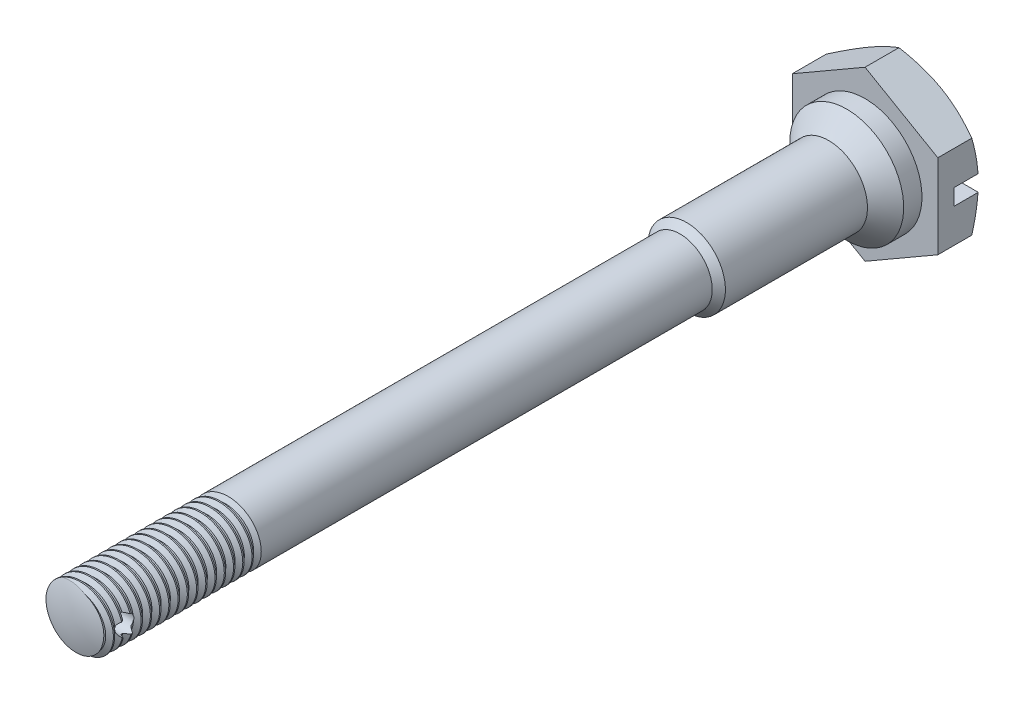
from build123d import *

# Parameters (mm, degrees)
EXTRUDE_1_DEPTH     = 3.96875
SKETCH_4_R          = 0.9271
SKETCH_4_W          = 2.38125
SKETCH_4_H          = 1.5875
CUT_EXTRUDE_1_DEPTH = 80.517746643


with BuildPart() as part:
    # Sketch 1 → Revolve 1 (revolve)
    with BuildSketch(Plane(origin=(0, 0, 0), x_dir=(0, 0, -1), z_dir=(1, 0, 0)), mode=Mode.PRIVATE) as revolve_1_sk:
        with BuildLine():
            Line((-77.7875, 0), (0, 0))
            Line((0, 0), (0, 5.588))
            Line((0, 5.588), (-1.793875, 5.588))
            Line((-1.793875, 5.588), (-3.571875, 3.81))
            Line((-3.571875, 3.81), (-17.5133, 3.81))
            Line((-17.5133, 3.81), (-18.161, 3.1623))
            Line((-18.161, 3.1623), (-77.247236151, 3.1623))
            ThreePointArc((-77.247236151, 3.1623), (-77.651462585, 1.604059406), (-77.7875, 0))
        make_face()
    revolve(revolve_1_sk.sketch.rotate(Axis((0, 0, 0), (0, 0, 1)), 90), axis=Axis((0, 0, 0), (0, 0, 1)))

    # Sketch 2 → Extrude 1 (add)
    with BuildSketch(Plane(origin=(0, 0, 0), x_dir=(-1, 0, 0), z_dir=(0, 0, -1))):
        Polygon((0, 8.248891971), (-7.14375, 4.124445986), (-7.14375, -4.124445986), (0, -8.248891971), (7.14375, -4.124445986), (7.14375, 4.124445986), align=None)
    extrude(amount=EXTRUDE_1_DEPTH)

    # Sketch 3 → Cut-Revolve 1 (revolve, cut)
    with BuildSketch(Plane(origin=(0, 0, 0), x_dir=(0, 0, -1), z_dir=(1, 0, 0))):
        Polygon((3.330695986, 8.248891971), (3.96875, 8.248891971), (3.96875, 7.14375), align=None)
    revolve(axis=Axis((0, 0, 0), (0, 0, -1)), mode=Mode.SUBTRACT)

    # Sketch 4 → Cut-Extrude 1 (cut, through all)
    with BuildSketch(Plane(origin=(7.14375, 0, 0), x_dir=(0, 0, -1), z_dir=(1, 0, 0))):
        with Locations((-75.40625, 0)):
            Circle(SKETCH_4_R)
        with Locations((2.778125, 0)):
            Rectangle(SKETCH_4_W, SKETCH_4_H)
    extrude(amount=-CUT_EXTRUDE_1_DEPTH, mode=Mode.SUBTRACT)

    # Sweep 1: sweep along a curve in space
    with BuildLine() as sweep_1_path:
        add(Edge.make_bspline(
            [(3.175, 0, 77.7875), (3.175, -0.412946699, 77.76872214), (3.009683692, -1.247860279, 77.730747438), (2.303512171, -2.303188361, 77.674122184), (1.246651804, -3.009770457, 77.617406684), (0, -3.257634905, 77.560715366), (-1.246651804, -3.009689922, 77.504017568), (-2.303512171, -2.303510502, 77.447321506), (-3.009683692, -1.246652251, 77.390624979), (-3.257658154, 1.2e-07, 77.333928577), (-3.009683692, 1.246651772, 77.277232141), (-2.303512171, 2.30351218, 77.220535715), (-1.246651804, 3.00968369, 77.163839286), (0, 3.257658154, 77.107142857), (1.246651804, 3.009683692, 77.050446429), (2.303512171, 2.303512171, 76.99375), (3.009683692, 1.246651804, 76.937053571), (3.257658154, 0, 76.880357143), (3.009683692, -1.246651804, 76.823660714), (2.303512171, -2.303512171, 76.766964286), (1.246651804, -3.009683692, 76.710267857), (0, -3.257658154, 76.653571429), (-1.246651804, -3.009683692, 76.596875), (-2.303512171, -2.303512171, 76.540178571), (-3.009683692, -1.246651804, 76.483482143), (-3.257658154, 0, 76.426785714), (-3.009683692, 1.246651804, 76.370089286), (-2.303512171, 2.303512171, 76.313392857), (-1.246651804, 3.009683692, 76.256696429), (0, 3.257658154, 76.2), (1.246651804, 3.009683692, 76.143303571), (2.303512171, 2.303512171, 76.086607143), (3.009683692, 1.246651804, 76.029910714), (3.257658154, 0, 75.973214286), (3.009683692, -1.246651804, 75.916517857), (2.303512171, -2.303512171, 75.859821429), (1.246651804, -3.009683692, 75.803125), (0, -3.257658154, 75.746428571), (-1.246651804, -3.009683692, 75.689732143), (-2.303512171, -2.303512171, 75.633035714), (-3.009683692, -1.246651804, 75.576339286), (-3.257658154, 0, 75.519642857), (-3.009683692, 1.246651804, 75.462946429), (-2.303512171, 2.303512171, 75.40625), (-1.246651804, 3.009683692, 75.349553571), (0, 3.257658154, 75.292857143), (1.246651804, 3.009683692, 75.236160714), (2.303512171, 2.303512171, 75.179464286), (3.009683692, 1.246651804, 75.122767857), (3.257658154, 0, 75.066071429), (3.009683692, -1.246651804, 75.009375), (2.303512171, -2.303512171, 74.952678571), (1.246651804, -3.009683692, 74.895982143), (0, -3.257658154, 74.839285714), (-1.246651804, -3.009683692, 74.782589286), (-2.303512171, -2.303512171, 74.725892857), (-3.009683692, -1.246651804, 74.669196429), (-3.257658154, 0, 74.6125), (-3.009683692, 1.246651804, 74.555803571), (-2.303512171, 2.303512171, 74.499107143), (-1.246651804, 3.009683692, 74.442410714), (0, 3.257658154, 74.385714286), (1.246651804, 3.009683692, 74.329017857), (2.303512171, 2.303512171, 74.272321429), (3.009683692, 1.246651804, 74.215625), (3.257658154, 0, 74.158928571), (3.009683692, -1.246651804, 74.102232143), (2.303512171, -2.303512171, 74.045535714), (1.246651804, -3.009683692, 73.988839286), (0, -3.257658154, 73.932142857), (-1.246651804, -3.009683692, 73.875446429), (-2.303512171, -2.303512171, 73.81875), (-3.009683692, -1.246651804, 73.762053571), (-3.257658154, 0, 73.705357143), (-3.009683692, 1.246651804, 73.648660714), (-2.303512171, 2.303512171, 73.591964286), (-1.246651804, 3.009683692, 73.535267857), (0, 3.257658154, 73.478571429), (1.246651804, 3.009683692, 73.421875), (2.303512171, 2.303512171, 73.365178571), (3.009683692, 1.246651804, 73.308482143), (3.257658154, 0, 73.251785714), (3.009683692, -1.246651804, 73.195089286), (2.303512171, -2.303512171, 73.138392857), (1.246651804, -3.009683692, 73.081696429), (0, -3.257658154, 73.025), (-1.246651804, -3.009683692, 72.968303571), (-2.303512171, -2.303512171, 72.911607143), (-3.009683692, -1.246651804, 72.854910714), (-3.257658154, 0, 72.798214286), (-3.009683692, 1.246651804, 72.741517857), (-2.303512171, 2.303512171, 72.684821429), (-1.246651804, 3.009683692, 72.628125), (0, 3.257658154, 72.571428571), (1.246651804, 3.009683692, 72.514732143), (2.303512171, 2.303512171, 72.458035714), (3.009683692, 1.246651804, 72.401339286), (3.257658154, 0, 72.344642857), (3.009683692, -1.246651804, 72.287946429), (2.303512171, -2.303512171, 72.23125), (1.246651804, -3.009683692, 72.174553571), (0, -3.257658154, 72.117857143), (-1.246651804, -3.009683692, 72.061160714), (-2.303512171, -2.303512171, 72.004464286), (-3.009683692, -1.246651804, 71.947767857), (-3.257658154, 0, 71.891071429), (-3.009683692, 1.246651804, 71.834375), (-2.303512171, 2.303512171, 71.777678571), (-1.246651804, 3.009683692, 71.720982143), (0, 3.257658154, 71.664285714), (1.246651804, 3.009683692, 71.607589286), (2.303512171, 2.303512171, 71.550892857), (3.009683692, 1.246651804, 71.494196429), (3.257658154, 0, 71.4375), (3.009683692, -1.246651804, 71.380803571), (2.303512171, -2.303512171, 71.324107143), (1.246651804, -3.009683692, 71.267410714), (0, -3.257658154, 71.210714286), (-1.246651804, -3.009683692, 71.154017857), (-2.303512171, -2.303512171, 71.097321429), (-3.009683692, -1.246651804, 71.040625), (-3.257658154, 0, 70.983928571), (-3.009683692, 1.246651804, 70.927232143), (-2.303512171, 2.303512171, 70.870535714), (-1.246651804, 3.009683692, 70.813839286), (0, 3.257658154, 70.757142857), (1.246651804, 3.009683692, 70.700446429), (2.303512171, 2.303512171, 70.64375), (3.009683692, 1.246651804, 70.587053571), (3.257658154, 0, 70.530357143), (3.009683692, -1.246651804, 70.473660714), (2.303512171, -2.303512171, 70.416964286), (1.246651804, -3.009683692, 70.360267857), (0, -3.257658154, 70.303571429), (-1.246651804, -3.009683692, 70.246875), (-2.303512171, -2.303512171, 70.190178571), (-3.009683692, -1.246651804, 70.133482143), (-3.257658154, 0, 70.076785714), (-3.009683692, 1.246651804, 70.020089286), (-2.303512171, 2.303512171, 69.963392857), (-1.246651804, 3.009683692, 69.906696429), (0, 3.257658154, 69.85), (1.246651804, 3.009683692, 69.793303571), (2.303512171, 2.303512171, 69.736607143), (3.009683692, 1.246651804, 69.679910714), (3.257658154, 0, 69.623214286), (3.009683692, -1.246651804, 69.566517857), (2.303512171, -2.303512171, 69.509821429), (1.246651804, -3.009683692, 69.453125), (0, -3.257658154, 69.396428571), (-1.246651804, -3.009683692, 69.339732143), (-2.303512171, -2.303512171, 69.283035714), (-3.009683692, -1.246651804, 69.226339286), (-3.257658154, 0, 69.169642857), (-3.009683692, 1.246651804, 69.112946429), (-2.303512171, 2.303512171, 69.05625), (-1.246651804, 3.009683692, 68.999553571), (0, 3.257658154, 68.942857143), (1.246651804, 3.009683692, 68.886160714), (2.303512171, 2.303512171, 68.829464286), (3.009683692, 1.246651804, 68.772767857), (3.257658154, 0, 68.716071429), (3.009683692, -1.246651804, 68.659375), (2.303512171, -2.303512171, 68.602678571), (1.246651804, -3.009683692, 68.545982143), (0, -3.257658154, 68.489285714), (-1.246651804, -3.009683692, 68.432589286), (-2.303512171, -2.303512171, 68.375892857), (-3.009683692, -1.246651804, 68.319196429), (-3.257658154, 0, 68.2625), (-3.009683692, 1.246651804, 68.205803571), (-2.303512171, 2.303512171, 68.149107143), (-1.246651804, 3.009683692, 68.092410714), (0, 3.257658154, 68.035714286), (1.246651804, 3.009683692, 67.979017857), (2.303512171, 2.303512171, 67.922321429), (3.009683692, 1.246651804, 67.865625), (3.257658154, 0, 67.808928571), (3.009683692, -1.246651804, 67.752232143), (2.303512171, -2.303512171, 67.695535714), (1.246651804, -3.009683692, 67.638839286), (0, -3.257658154, 67.582142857), (-1.246651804, -3.009683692, 67.525446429), (-2.303512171, -2.303512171, 67.46875), (-3.009683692, -1.246651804, 67.412053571), (-3.257658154, 0, 67.355357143), (-3.009683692, 1.246651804, 67.298660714), (-2.303512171, 2.303512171, 67.241964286), (-1.246651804, 3.009683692, 67.185267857), (0, 3.257658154, 67.128571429), (1.246651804, 3.009683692, 67.071875), (2.303512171, 2.303512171, 67.015178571), (3.009683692, 1.246651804, 66.958482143), (3.257658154, 0, 66.901785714), (3.009683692, -1.246651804, 66.845089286), (2.303512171, -2.303512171, 66.788392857), (1.246651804, -3.009683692, 66.731696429), (0, -3.257658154, 66.675), (-1.246651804, -3.009683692, 66.618303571), (-2.303512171, -2.303512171, 66.561607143), (-3.009683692, -1.246651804, 66.504910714), (-3.257658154, 0, 66.448214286), (-3.009683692, 1.246651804, 66.391517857), (-2.303512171, 2.303512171, 66.334821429), (-1.246651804, 3.009683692, 66.278125), (0, 3.257658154, 66.221428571), (1.246651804, 3.009683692, 66.164732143), (2.303512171, 2.303512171, 66.108035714), (3.009683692, 1.246651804, 66.051339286), (3.257658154, 0, 65.994642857), (3.009683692, -1.246651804, 65.937946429), (2.303512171, -2.303512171, 65.88125), (1.246651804, -3.009683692, 65.824553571), (0, -3.257658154, 65.767857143), (-1.246651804, -3.009683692, 65.711160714), (-2.303512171, -2.303512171, 65.654464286), (-3.009683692, -1.246651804, 65.597767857), (-3.257658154, 0, 65.541071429), (-3.009683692, 1.246651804, 65.484375), (-2.303512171, 2.303512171, 65.427678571), (-1.246651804, 3.009683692, 65.370982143), (0, 3.257658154, 65.314285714), (1.246651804, 3.009683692, 65.257589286), (2.303512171, 2.303512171, 65.200892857), (3.009683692, 1.246651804, 65.144196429), (3.257658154, 0, 65.0875), (3.009683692, -1.246651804, 65.030803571), (2.303512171, -2.303512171, 64.974107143), (1.246651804, -3.009683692, 64.917410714), (0, -3.257658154, 64.860714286), (-1.246651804, -3.009683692, 64.804017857), (-2.303512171, -2.303512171, 64.747321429), (-3.009683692, -1.246651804, 64.690625), (-3.257658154, 0, 64.633928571), (-3.009683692, 1.246651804, 64.577232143), (-2.303512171, 2.303512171, 64.520535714), (-1.246651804, 3.009683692, 64.463839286), (0, 3.257658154, 64.407142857), (1.246651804, 3.009683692, 64.350446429), (2.303512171, 2.303512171, 64.29375), (3.009683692, 1.246651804, 64.237053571), (3.257658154, 0, 64.180357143), (3.009683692, -1.246651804, 64.123660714), (2.303512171, -2.303512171, 64.066964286), (1.246651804, -3.009683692, 64.010267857), (0, -3.257658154, 63.953571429), (-1.246651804, -3.009683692, 63.896875), (-2.303512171, -2.303512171, 63.840178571), (-3.009683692, -1.246651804, 63.783482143), (-3.257658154, 0, 63.726785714), (-3.009683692, 1.246651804, 63.670089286), (-2.303512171, 2.303512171, 63.613392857), (-1.246651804, 3.009683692, 63.556696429), (0, 3.257658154, 63.5), (1.246651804, 3.009683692, 63.443303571), (2.303512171, 2.303512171, 63.386607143), (3.009683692, 1.246651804, 63.329910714), (3.257658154, 0, 63.273214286), (3.009683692, -1.246651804, 63.216517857), (2.303512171, -2.303512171, 63.159821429), (1.246651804, -3.009683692, 63.103125), (0, -3.257658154, 63.046428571), (-1.246651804, -3.009683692, 62.989732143), (-2.303512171, -2.303512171, 62.933035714), (-3.009683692, -1.246651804, 62.876339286), (-3.257658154, 0, 62.819642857), (-3.009683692, 1.246651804, 62.762946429), (-2.303512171, 2.303512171, 62.70625), (-1.246651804, 3.009683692, 62.649553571), (0, 3.257658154, 62.592857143), (1.246651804, 3.00968369, 62.536160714), (2.303512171, 2.30351218, 62.479464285), (3.009683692, 1.246651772, 62.422767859), (3.257658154, 1.2e-07, 62.366071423), (3.009683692, -1.246652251, 62.309375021), (2.303512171, -2.303510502, 62.252678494), (1.246651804, -3.009689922, 62.195982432), (0, -3.257634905, 62.139284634), (-1.246651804, -3.009770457, 62.082593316), (-2.303512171, -2.303188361, 62.025877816), (-3.009683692, -1.247860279, 61.969252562), (-3.175, -0.412946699, 61.93127786), (-3.175, 0, 61.9125)],
            knots=[0, 0, 0, 0, 0.003571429, 0.007142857, 0.010714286, 0.014285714, 0.017857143, 0.021428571, 0.025, 0.028571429, 0.032142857, 0.035714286, 0.039285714, 0.042857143, 0.046428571, 0.05, 0.053571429, 0.057142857, 0.060714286, 0.064285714, 0.067857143, 0.071428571, 0.075, 0.078571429, 0.082142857, 0.085714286, 0.089285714, 0.092857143, 0.096428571, 0.1, 0.103571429, 0.107142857, 0.110714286, 0.114285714, 0.117857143, 0.121428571, 0.125, 0.128571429, 0.132142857, 0.135714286, 0.139285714, 0.142857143, 0.146428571, 0.15, 0.153571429, 0.157142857, 0.160714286, 0.164285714, 0.167857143, 0.171428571, 0.175, 0.178571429, 0.182142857, 0.185714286, 0.189285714, 0.192857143, 0.196428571, 0.2, 0.203571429, 0.207142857, 0.210714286, 0.214285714, 0.217857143, 0.221428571, 0.225, 0.228571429, 0.232142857, 0.235714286, 0.239285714, 0.242857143, 0.246428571, 0.25, 0.253571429, 0.257142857, 0.260714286, 0.264285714, 0.267857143, 0.271428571, 0.275, 0.278571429, 0.282142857, 0.285714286, 0.289285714, 0.292857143, 0.296428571, 0.3, 0.303571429, 0.307142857, 0.310714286, 0.314285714, 0.317857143, 0.321428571, 0.325, 0.328571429, 0.332142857, 0.335714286, 0.339285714, 0.342857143, 0.346428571, 0.35, 0.353571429, 0.357142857, 0.360714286, 0.364285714, 0.367857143, 0.371428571, 0.375, 0.378571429, 0.382142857, 0.385714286, 0.389285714, 0.392857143, 0.396428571, 0.4, 0.403571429, 0.407142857, 0.410714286, 0.414285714, 0.417857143, 0.421428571, 0.425, 0.428571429, 0.432142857, 0.435714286, 0.439285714, 0.442857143, 0.446428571, 0.45, 0.453571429, 0.457142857, 0.460714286, 0.464285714, 0.467857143, 0.471428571, 0.475, 0.478571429, 0.482142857, 0.485714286, 0.489285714, 0.492857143, 0.496428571, 0.5, 0.503571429, 0.507142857, 0.510714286, 0.514285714, 0.517857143, 0.521428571, 0.525, 0.528571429, 0.532142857, 0.535714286, 0.539285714, 0.542857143, 0.546428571, 0.55, 0.553571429, 0.557142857, 0.560714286, 0.564285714, 0.567857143, 0.571428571, 0.575, 0.578571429, 0.582142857, 0.585714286, 0.589285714, 0.592857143, 0.596428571, 0.6, 0.603571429, 0.607142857, 0.610714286, 0.614285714, 0.617857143, 0.621428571, 0.625, 0.628571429, 0.632142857, 0.635714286, 0.639285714, 0.642857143, 0.646428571, 0.65, 0.653571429, 0.657142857, 0.660714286, 0.664285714, 0.667857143, 0.671428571, 0.675, 0.678571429, 0.682142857, 0.685714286, 0.689285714, 0.692857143, 0.696428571, 0.7, 0.703571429, 0.707142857, 0.710714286, 0.714285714, 0.717857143, 0.721428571, 0.725, 0.728571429, 0.732142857, 0.735714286, 0.739285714, 0.742857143, 0.746428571, 0.75, 0.753571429, 0.757142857, 0.760714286, 0.764285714, 0.767857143, 0.771428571, 0.775, 0.778571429, 0.782142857, 0.785714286, 0.789285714, 0.792857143, 0.796428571, 0.8, 0.803571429, 0.807142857, 0.810714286, 0.814285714, 0.817857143, 0.821428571, 0.825, 0.828571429, 0.832142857, 0.835714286, 0.839285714, 0.842857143, 0.846428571, 0.85, 0.853571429, 0.857142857, 0.860714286, 0.864285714, 0.867857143, 0.871428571, 0.875, 0.878571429, 0.882142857, 0.885714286, 0.889285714, 0.892857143, 0.896428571, 0.9, 0.903571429, 0.907142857, 0.910714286, 0.914285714, 0.917857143, 0.921428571, 0.925, 0.928571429, 0.932142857, 0.935714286, 0.939285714, 0.942857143, 0.946428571, 0.95, 0.953571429, 0.957142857, 0.960714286, 0.964285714, 0.967857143, 0.971428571, 0.975, 0.978571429, 0.982142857, 0.985714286, 0.989285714, 0.992857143, 0.996428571, 1, 1, 1, 1], degree=3))
    # Sketch 6 → Sweep 1 (sweep, cut)
    with BuildSketch(Plane(origin=(0, 0, 0), x_dir=(1, 0, 0), z_dir=(0, 1, 0))):
        Polygon((3.175, -77.844196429), (3.175, -78.637946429), (2.683994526, -78.354464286), (2.683994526, -78.127678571), align=None)
    sweep(path=sweep_1_path.line, is_frenet=True, mode=Mode.SUBTRACT)


solid = part.part
